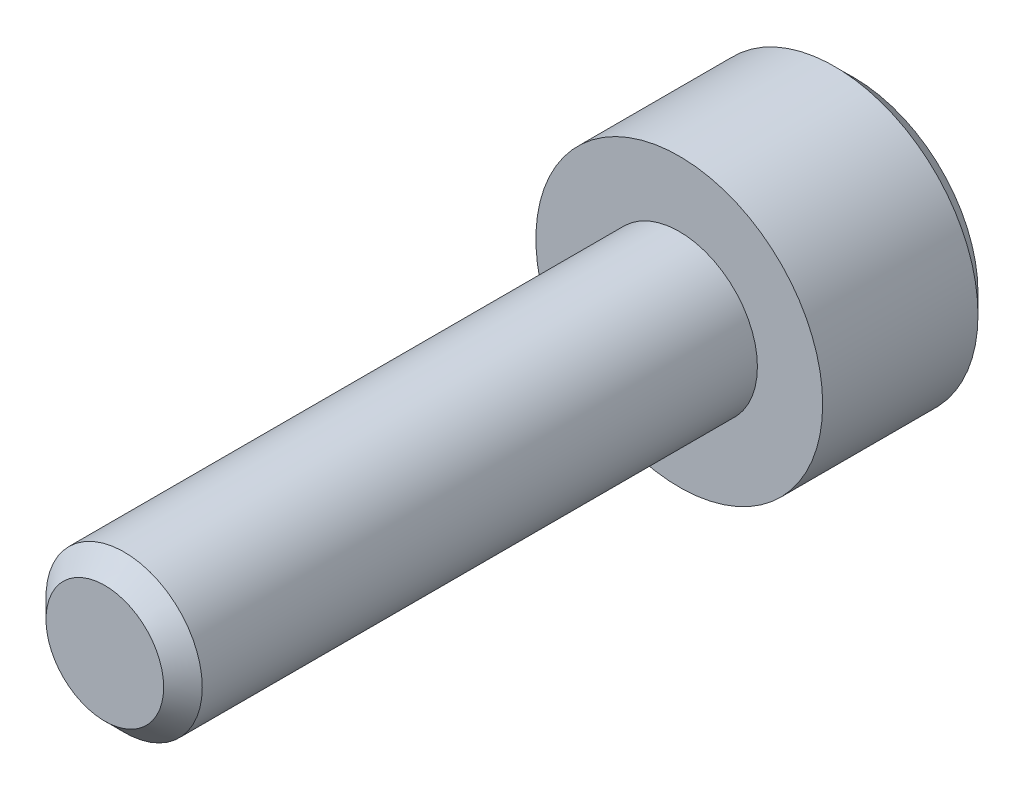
from build123d import *

# Parameters (mm, degrees)
CUT_EXTRUDE1_DEPTH = 4.699
CHAMFER2_SIZE      = 0.5334
CHAMFER3_SIZE      = 0.5334


with BuildPart() as part:
    # Sketch1 → Revolve1 (revolve)
    with BuildSketch(Plane(origin=(0, 0, 0), x_dir=(1, 0, 0), z_dir=(0, 1, 0))):
        Polygon((0, -15.875), (2.159, -15.875), (2.159, 0), (3.9624, 0), (3.9624, 4.826), (0, 4.826), (0, 0), align=None)
    revolve(axis=Axis((0, 0, 15.875), (0, 0, -1)))

    # Sketch2 → Cut-Extrude1 (cut)
    with BuildSketch(Plane(origin=(0, 0, -4.826), x_dir=(-1, 0, 0), z_dir=(0, 0, -1))):
        Polygon((-1.989084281, -1.137483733), (-0.009452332, -2.291339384), (1.97963195, -1.153855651), (1.989084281, 1.137483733), (0.009452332, 2.291339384), (-1.97963195, 1.153855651), align=None)
    extrude(amount=-CUT_EXTRUDE1_DEPTH, mode=Mode.SUBTRACT)

    # Chamfer2
    chamfer2_edges = [part.edges().sort_by_distance(p)[0] for p in [
        (-3.9624, 0, -4.826),
    ]]
    chamfer(chamfer2_edges, length=CHAMFER2_SIZE)

    # Chamfer3
    chamfer3_edges = [part.edges().sort_by_distance(p)[0] for p in [
        (-2.159, 0, 15.875),
    ]]
    chamfer(chamfer3_edges, length=CHAMFER3_SIZE)


solid = part.part
